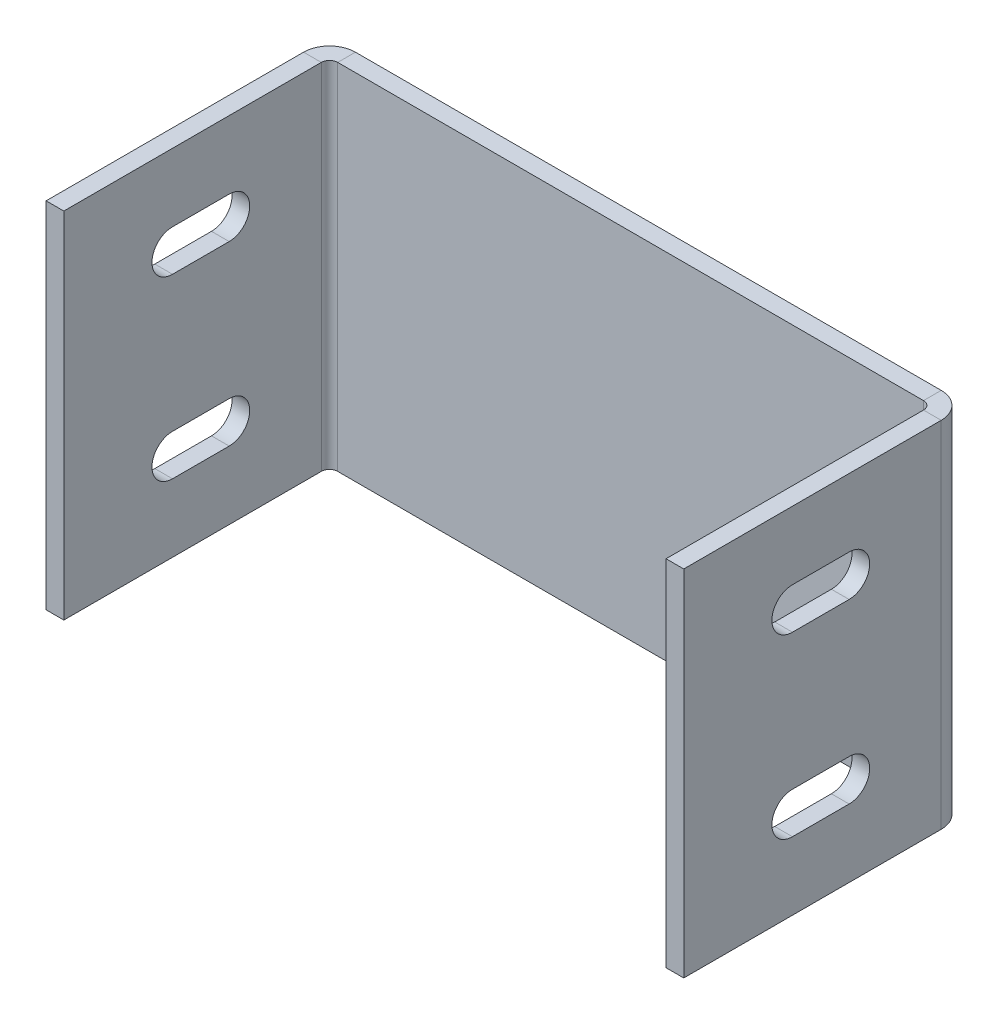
ISO-10303-21;
HEADER;
FILE_DESCRIPTION(('STEP AP214'),'2;1');
FILE_NAME('part.step','',(''),(''),'','','');
FILE_SCHEMA(('AUTOMOTIVE_DESIGN { 1 0 10303 214 1 1 1 1 }'));
ENDSEC;
DATA;
#1=APPLICATION_CONTEXT('core data for automotive mechanical design processes');
#2=APPLICATION_PROTOCOL_DEFINITION('international standard','automotive_design',2000,#1);
#3=PRODUCT_CONTEXT('',#1,'mechanical');
#4=PRODUCT('Part','Part','',(#3));
#5=PRODUCT_RELATED_PRODUCT_CATEGORY('part','',(#4));
#6=PRODUCT_DEFINITION_FORMATION('','',#4);
#7=PRODUCT_DEFINITION_CONTEXT('part definition',#1,'design');
#8=PRODUCT_DEFINITION('design','',#6,#7);
#9=PRODUCT_DEFINITION_SHAPE('','',#8);
#10=(LENGTH_UNIT() NAMED_UNIT(*) SI_UNIT(.MILLI.,.METRE.));
#11=(NAMED_UNIT(*) PLANE_ANGLE_UNIT() SI_UNIT($,.RADIAN.));
#12=(NAMED_UNIT(*) SI_UNIT($,.STERADIAN.) SOLID_ANGLE_UNIT());
#13=UNCERTAINTY_MEASURE_WITH_UNIT(LENGTH_MEASURE(1.E-05),#10,'distance_accuracy_value','');
#14=(GEOMETRIC_REPRESENTATION_CONTEXT(3) GLOBAL_UNCERTAINTY_ASSIGNED_CONTEXT((#13)) GLOBAL_UNIT_ASSIGNED_CONTEXT((#10,
#11,#12)) REPRESENTATION_CONTEXT('',''));
#15=CARTESIAN_POINT('',(0.,0.,0.));
#16=DIRECTION('',(0.,0.,1.));
#17=DIRECTION('',(1.,0.,0.));
#18=AXIS2_PLACEMENT_3D('',#15,#16,#17);
#19=CARTESIAN_POINT('',(0.,0.,-1.5875));
#20=DIRECTION('',(0.,0.,-1.));
#21=DIRECTION('',(-1.,0.,0.));
#22=AXIS2_PLACEMENT_3D('',#19,#20,#21);
#23=PLANE('',#22);
#24=DIRECTION('',(1.,0.,0.));
#25=VECTOR('',#24,1.);
#26=CARTESIAN_POINT('',(-26.9875,-15.875,-1.5875));
#27=LINE('',#26,#25);
#28=CARTESIAN_POINT('',(-26.2509,-15.875,-1.5875));
#29=VERTEX_POINT('',#28);
#30=CARTESIAN_POINT('',(26.2509,-15.875,-1.5875));
#31=VERTEX_POINT('',#30);
#32=EDGE_CURVE('E440',#29,#31,#27,.T.);
#33=ORIENTED_EDGE('',*,*,#32,.F.);
#34=DIRECTION('',(0.,-1.,0.));
#35=VECTOR('',#34,1.);
#36=CARTESIAN_POINT('',(-26.2509,-15.875,-1.5875));
#37=LINE('',#36,#35);
#38=CARTESIAN_POINT('',(-26.2509,15.875,-1.5875));
#39=VERTEX_POINT('',#38);
#40=EDGE_CURVE('E361',#29,#39,#37,.F.);
#41=ORIENTED_EDGE('',*,*,#40,.T.);
#42=DIRECTION('',(-1.,0.,0.));
#43=VECTOR('',#42,1.);
#44=CARTESIAN_POINT('',(-26.9875,15.875,-1.5875));
#45=LINE('',#44,#43);
#46=CARTESIAN_POINT('',(26.2509,15.875,-1.5875));
#47=VERTEX_POINT('',#46);
#48=EDGE_CURVE('E437',#47,#39,#45,.T.);
#49=ORIENTED_EDGE('',*,*,#48,.F.);
#50=DIRECTION('',(0.,1.,0.));
#51=VECTOR('',#50,1.);
#52=CARTESIAN_POINT('',(26.2509,15.875,-1.5875));
#53=LINE('',#52,#51);
#54=EDGE_CURVE('E414',#47,#31,#53,.F.);
#55=ORIENTED_EDGE('',*,*,#54,.T.);
#56=EDGE_LOOP('',(#33,#41,#49,#55));
#57=FACE_BOUND('',#56,.T.);
#58=ADVANCED_FACE('F40',(#57),#23,.T.);
#59=CARTESIAN_POINT('',(0.,0.,0.));
#60=DIRECTION('',(0.,0.,-1.));
#61=DIRECTION('',(-1.,0.,0.));
#62=AXIS2_PLACEMENT_3D('',#59,#60,#61);
#63=PLANE('',#62);
#64=DIRECTION('',(0.,-1.,0.));
#65=VECTOR('',#64,1.);
#66=CARTESIAN_POINT('',(-26.2509,-15.875,0.));
#67=LINE('',#66,#65);
#68=CARTESIAN_POINT('',(-26.2509,-15.875,0.));
#69=VERTEX_POINT('',#68);
#70=CARTESIAN_POINT('',(-26.2509,15.875,0.));
#71=VERTEX_POINT('',#70);
#72=EDGE_CURVE('E374',#69,#71,#67,.F.);
#73=ORIENTED_EDGE('',*,*,#72,.F.);
#74=DIRECTION('',(1.,0.,0.));
#75=VECTOR('',#74,1.);
#76=CARTESIAN_POINT('',(-26.9875,-15.875,0.));
#77=LINE('',#76,#75);
#78=CARTESIAN_POINT('',(26.2509,-15.875,0.));
#79=VERTEX_POINT('',#78);
#80=EDGE_CURVE('E441',#69,#79,#77,.T.);
#81=ORIENTED_EDGE('',*,*,#80,.T.);
#82=DIRECTION('',(0.,1.,0.));
#83=VECTOR('',#82,1.);
#84=CARTESIAN_POINT('',(26.2509,15.875,0.));
#85=LINE('',#84,#83);
#86=CARTESIAN_POINT('',(26.2509,15.875,0.));
#87=VERTEX_POINT('',#86);
#88=EDGE_CURVE('E427',#87,#79,#85,.F.);
#89=ORIENTED_EDGE('',*,*,#88,.F.);
#90=DIRECTION('',(-1.,0.,0.));
#91=VECTOR('',#90,1.);
#92=CARTESIAN_POINT('',(-26.9875,15.875,0.));
#93=LINE('',#92,#91);
#94=EDGE_CURVE('E434',#87,#71,#93,.T.);
#95=ORIENTED_EDGE('',*,*,#94,.T.);
#96=EDGE_LOOP('',(#73,#81,#89,#95));
#97=FACE_BOUND('',#96,.T.);
#98=ADVANCED_FACE('F484',(#97),#63,.F.);
#99=CARTESIAN_POINT('',(-26.9875,-15.875,-1.5875));
#100=DIRECTION('',(0.,-1.,0.));
#101=DIRECTION('',(0.,0.,-1.));
#102=AXIS2_PLACEMENT_3D('',#99,#100,#101);
#103=PLANE('',#102);
#104=ORIENTED_EDGE('',*,*,#80,.F.);
#105=DIRECTION('',(0.,0.,-1.));
#106=VECTOR('',#105,1.);
#107=CARTESIAN_POINT('',(-26.2509,-15.875,0.));
#108=LINE('',#107,#106);
#109=EDGE_CURVE('E368',#69,#29,#108,.T.);
#110=ORIENTED_EDGE('',*,*,#109,.T.);
#111=ORIENTED_EDGE('',*,*,#32,.T.);
#112=DIRECTION('',(0.,0.,-1.));
#113=VECTOR('',#112,1.);
#114=CARTESIAN_POINT('',(26.2509,-15.875,0.));
#115=LINE('',#114,#113);
#116=EDGE_CURVE('E431',#79,#31,#115,.T.);
#117=ORIENTED_EDGE('',*,*,#116,.F.);
#118=EDGE_LOOP('',(#104,#110,#111,#117));
#119=FACE_BOUND('',#118,.T.);
#120=ADVANCED_FACE('F490',(#119),#103,.T.);
#121=CARTESIAN_POINT('',(-26.9875,15.875,-1.5875));
#122=DIRECTION('',(0.,1.,0.));
#123=DIRECTION('',(0.,0.,1.));
#124=AXIS2_PLACEMENT_3D('',#121,#122,#123);
#125=PLANE('',#124);
#126=DIRECTION('',(0.,0.,-1.));
#127=VECTOR('',#126,1.);
#128=CARTESIAN_POINT('',(-26.2509,15.875,0.));
#129=LINE('',#128,#127);
#130=EDGE_CURVE('E378',#71,#39,#129,.T.);
#131=ORIENTED_EDGE('',*,*,#130,.F.);
#132=ORIENTED_EDGE('',*,*,#94,.F.);
#133=DIRECTION('',(0.,0.,-1.));
#134=VECTOR('',#133,1.);
#135=CARTESIAN_POINT('',(26.2509,15.875,0.));
#136=LINE('',#135,#134);
#137=EDGE_CURVE('E421',#87,#47,#136,.T.);
#138=ORIENTED_EDGE('',*,*,#137,.T.);
#139=ORIENTED_EDGE('',*,*,#48,.T.);
#140=EDGE_LOOP('',(#131,#132,#138,#139));
#141=FACE_BOUND('',#140,.T.);
#142=ADVANCED_FACE('F42',(#141),#125,.T.);
#143=CARTESIAN_POINT('',(26.2509,-15.875,0.7366));
#144=DIRECTION('',(0.,-1.,0.));
#145=DIRECTION('',(0.,0.,-1.));
#146=AXIS2_PLACEMENT_3D('',#143,#144,#145);
#147=PLANE('',#146);
#148=DIRECTION('',(1.,0.,0.));
#149=VECTOR('',#148,1.);
#150=CARTESIAN_POINT('',(26.9875,-15.875,0.736599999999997));
#151=LINE('',#150,#149);
#152=CARTESIAN_POINT('',(26.9875,-15.875,0.736599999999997));
#153=VERTEX_POINT('',#152);
#154=CARTESIAN_POINT('',(28.575,-15.875,0.736599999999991));
#155=VERTEX_POINT('',#154);
#156=EDGE_CURVE('E381',#153,#155,#151,.T.);
#157=ORIENTED_EDGE('',*,*,#156,.F.);
#158=CARTESIAN_POINT('',(26.2509,-15.875,0.7366));
#159=DIRECTION('',(0.,1.,0.));
#160=DIRECTION('',(0.,0.,1.));
#161=AXIS2_PLACEMENT_3D('',#158,#159,#160);
#162=CIRCLE('',#161,0.7366);
#163=EDGE_CURVE('E424',#79,#153,#162,.F.);
#164=ORIENTED_EDGE('',*,*,#163,.F.);
#165=ORIENTED_EDGE('',*,*,#116,.T.);
#166=CARTESIAN_POINT('',(26.2509,-15.875,0.7366));
#167=DIRECTION('',(0.,1.,0.));
#168=DIRECTION('',(0.,0.,1.));
#169=AXIS2_PLACEMENT_3D('',#166,#167,#168);
#170=CIRCLE('',#169,2.3241);
#171=EDGE_CURVE('E417',#31,#155,#170,.F.);
#172=ORIENTED_EDGE('',*,*,#171,.T.);
#173=EDGE_LOOP('',(#157,#164,#165,#172));
#174=FACE_BOUND('',#173,.T.);
#175=ADVANCED_FACE('F502',(#174),#147,.T.);
#176=CARTESIAN_POINT('',(26.2509,15.875,0.7366));
#177=DIRECTION('',(0.,-1.,0.));
#178=DIRECTION('',(0.,0.,-1.));
#179=AXIS2_PLACEMENT_3D('',#176,#177,#178);
#180=PLANE('',#179);
#181=CARTESIAN_POINT('',(26.2509,15.875,0.7366));
#182=DIRECTION('',(0.,1.,0.));
#183=DIRECTION('',(0.,0.,1.));
#184=AXIS2_PLACEMENT_3D('',#181,#182,#183);
#185=CIRCLE('',#184,0.7366);
#186=CARTESIAN_POINT('',(26.9875,15.875,0.736599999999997));
#187=VERTEX_POINT('',#186);
#188=EDGE_CURVE('E413',#187,#87,#185,.T.);
#189=ORIENTED_EDGE('',*,*,#188,.F.);
#190=DIRECTION('',(1.,0.,0.));
#191=VECTOR('',#190,1.);
#192=CARTESIAN_POINT('',(26.9875,15.875,0.736599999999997));
#193=LINE('',#192,#191);
#194=CARTESIAN_POINT('',(28.575,15.875,0.736599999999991));
#195=VERTEX_POINT('',#194);
#196=EDGE_CURVE('E386',#187,#195,#193,.T.);
#197=ORIENTED_EDGE('',*,*,#196,.T.);
#198=CARTESIAN_POINT('',(26.2509,15.875,0.7366));
#199=DIRECTION('',(0.,1.,0.));
#200=DIRECTION('',(0.,0.,1.));
#201=AXIS2_PLACEMENT_3D('',#198,#199,#200);
#202=CIRCLE('',#201,2.3241);
#203=EDGE_CURVE('E418',#195,#47,#202,.T.);
#204=ORIENTED_EDGE('',*,*,#203,.T.);
#205=ORIENTED_EDGE('',*,*,#137,.F.);
#206=EDGE_LOOP('',(#189,#197,#204,#205));
#207=FACE_BOUND('',#206,.T.);
#208=ADVANCED_FACE('F495',(#207),#180,.F.);
#209=CARTESIAN_POINT('',(26.2509,15.875,0.7366));
#210=DIRECTION('',(0.,1.,0.));
#211=DIRECTION('',(1.,0.,0.));
#212=AXIS2_PLACEMENT_3D('',#209,#210,#211);
#213=CYLINDRICAL_SURFACE('',#212,2.3241);
#214=ORIENTED_EDGE('',*,*,#54,.F.);
#215=ORIENTED_EDGE('',*,*,#203,.F.);
#216=DIRECTION('',(0.,-1.,0.));
#217=VECTOR('',#216,1.);
#218=CARTESIAN_POINT('',(28.575,0.,0.736599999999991));
#219=LINE('',#218,#217);
#220=EDGE_CURVE('E389',#195,#155,#219,.T.);
#221=ORIENTED_EDGE('',*,*,#220,.T.);
#222=ORIENTED_EDGE('',*,*,#171,.F.);
#223=EDGE_LOOP('',(#214,#215,#221,#222));
#224=FACE_BOUND('',#223,.T.);
#225=ADVANCED_FACE('F584',(#224),#213,.T.);
#226=CARTESIAN_POINT('',(26.2509,15.875,0.7366));
#227=DIRECTION('',(0.,1.,0.));
#228=DIRECTION('',(1.,0.,0.));
#229=AXIS2_PLACEMENT_3D('',#226,#227,#228);
#230=CYLINDRICAL_SURFACE('',#229,0.7366);
#231=ORIENTED_EDGE('',*,*,#88,.T.);
#232=ORIENTED_EDGE('',*,*,#163,.T.);
#233=DIRECTION('',(0.,1.,0.));
#234=VECTOR('',#233,1.);
#235=CARTESIAN_POINT('',(26.9875,-15.875,0.736599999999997));
#236=LINE('',#235,#234);
#237=EDGE_CURVE('E384',#153,#187,#236,.T.);
#238=ORIENTED_EDGE('',*,*,#237,.T.);
#239=ORIENTED_EDGE('',*,*,#188,.T.);
#240=EDGE_LOOP('',(#231,#232,#238,#239));
#241=FACE_BOUND('',#240,.T.);
#242=ADVANCED_FACE('F582',(#241),#230,.F.);
#243=CARTESIAN_POINT('',(28.5750000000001,15.875,23.8125));
#244=DIRECTION('',(0.,-1.,0.));
#245=DIRECTION('',(0.,0.,-1.));
#246=AXIS2_PLACEMENT_3D('',#243,#244,#245);
#247=PLANE('',#246);
#248=ORIENTED_EDGE('',*,*,#196,.F.);
#249=DIRECTION('',(0.,0.,1.));
#250=VECTOR('',#249,1.);
#251=CARTESIAN_POINT('',(26.9875000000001,15.875,23.8125));
#252=LINE('',#251,#250);
#253=CARTESIAN_POINT('',(26.9875000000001,15.875,23.8125));
#254=VERTEX_POINT('',#253);
#255=EDGE_CURVE('E393',#187,#254,#252,.T.);
#256=ORIENTED_EDGE('',*,*,#255,.T.);
#257=DIRECTION('',(-1.,0.,0.));
#258=VECTOR('',#257,1.);
#259=CARTESIAN_POINT('',(28.5750000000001,15.875,23.8125));
#260=LINE('',#259,#258);
#261=CARTESIAN_POINT('',(28.5750000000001,15.875,23.8125));
#262=VERTEX_POINT('',#261);
#263=EDGE_CURVE('E410',#262,#254,#260,.T.);
#264=ORIENTED_EDGE('',*,*,#263,.F.);
#265=DIRECTION('',(0.,0.,1.));
#266=VECTOR('',#265,1.);
#267=CARTESIAN_POINT('',(28.5750000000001,15.875,23.8125));
#268=LINE('',#267,#266);
#269=EDGE_CURVE('E394',#195,#262,#268,.T.);
#270=ORIENTED_EDGE('',*,*,#269,.F.);
#271=EDGE_LOOP('',(#248,#256,#264,#270));
#272=FACE_BOUND('',#271,.T.);
#273=ADVANCED_FACE('F575',(#272),#247,.F.);
#274=CARTESIAN_POINT('',(28.575,-15.875,0.));
#275=DIRECTION('',(0.,1.,0.));
#276=DIRECTION('',(0.,0.,1.));
#277=AXIS2_PLACEMENT_3D('',#274,#275,#276);
#278=PLANE('',#277);
#279=ORIENTED_EDGE('',*,*,#156,.T.);
#280=DIRECTION('',(0.,0.,-1.));
#281=VECTOR('',#280,1.);
#282=CARTESIAN_POINT('',(28.575,-15.875,0.));
#283=LINE('',#282,#281);
#284=CARTESIAN_POINT('',(28.5750000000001,-15.875,23.8125));
#285=VERTEX_POINT('',#284);
#286=EDGE_CURVE('E399',#285,#155,#283,.T.);
#287=ORIENTED_EDGE('',*,*,#286,.F.);
#288=DIRECTION('',(-1.,0.,0.));
#289=VECTOR('',#288,1.);
#290=CARTESIAN_POINT('',(28.5750000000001,-15.875,23.8125));
#291=LINE('',#290,#289);
#292=CARTESIAN_POINT('',(26.9875000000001,-15.875,23.8125));
#293=VERTEX_POINT('',#292);
#294=EDGE_CURVE('E402',#285,#293,#291,.T.);
#295=ORIENTED_EDGE('',*,*,#294,.T.);
#296=DIRECTION('',(0.,0.,-1.));
#297=VECTOR('',#296,1.);
#298=CARTESIAN_POINT('',(26.9875,-15.875,0.));
#299=LINE('',#298,#297);
#300=EDGE_CURVE('E397',#293,#153,#299,.T.);
#301=ORIENTED_EDGE('',*,*,#300,.T.);
#302=EDGE_LOOP('',(#279,#287,#295,#301));
#303=FACE_BOUND('',#302,.T.);
#304=ADVANCED_FACE('F568',(#303),#278,.F.);
#305=CARTESIAN_POINT('',(28.575,0.,0.));
#306=DIRECTION('',(-1.,0.,0.));
#307=DIRECTION('',(0.,0.,1.));
#308=AXIS2_PLACEMENT_3D('',#305,#306,#307);
#309=PLANE('',#308);
#310=DIRECTION('',(0.,0.,-1.));
#311=VECTOR('',#310,1.);
#312=CARTESIAN_POINT('',(28.575,6.09600000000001,14.0716));
#313=LINE('',#312,#311);
#314=CARTESIAN_POINT('',(28.575,6.09600000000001,14.0716000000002));
#315=VERTEX_POINT('',#314);
#316=CARTESIAN_POINT('',(28.575,6.09600000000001,8.99159999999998));
#317=VERTEX_POINT('',#316);
#318=EDGE_CURVE('E262',#315,#317,#313,.T.);
#319=ORIENTED_EDGE('',*,*,#318,.F.);
#320=CARTESIAN_POINT('',(28.575,7.9375,14.0716));
#321=DIRECTION('',(1.,0.,0.));
#322=DIRECTION('',(0.,0.,-1.));
#323=AXIS2_PLACEMENT_3D('',#320,#321,#322);
#324=CIRCLE('',#323,1.8415);
#325=CARTESIAN_POINT('',(28.575,9.779,14.0716));
#326=VERTEX_POINT('',#325);
#327=EDGE_CURVE('E55',#326,#315,#324,.T.);
#328=ORIENTED_EDGE('',*,*,#327,.F.);
#329=DIRECTION('',(0.,0.,1.));
#330=VECTOR('',#329,1.);
#331=CARTESIAN_POINT('',(28.575,9.779,14.0716));
#332=LINE('',#331,#330);
#333=CARTESIAN_POINT('',(28.575,9.779,8.99159999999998));
#334=VERTEX_POINT('',#333);
#335=EDGE_CURVE('E253',#334,#326,#332,.T.);
#336=ORIENTED_EDGE('',*,*,#335,.F.);
#337=CARTESIAN_POINT('',(28.575,7.9375,8.99159999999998));
#338=DIRECTION('',(1.,0.,0.));
#339=DIRECTION('',(0.,0.,-1.));
#340=AXIS2_PLACEMENT_3D('',#337,#338,#339);
#341=CIRCLE('',#340,1.8415);
#342=EDGE_CURVE('E256',#317,#334,#341,.T.);
#343=ORIENTED_EDGE('',*,*,#342,.F.);
#344=EDGE_LOOP('',(#319,#328,#336,#343));
#345=FACE_BOUND('',#344,.T.);
#346=DIRECTION('',(0.,0.,-1.));
#347=VECTOR('',#346,1.);
#348=CARTESIAN_POINT('',(28.575,-9.779,14.0716));
#349=LINE('',#348,#347);
#350=CARTESIAN_POINT('',(28.575,-9.779,14.0716000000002));
#351=VERTEX_POINT('',#350);
#352=CARTESIAN_POINT('',(28.575,-9.779,8.99159999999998));
#353=VERTEX_POINT('',#352);
#354=EDGE_CURVE('E292',#351,#353,#349,.T.);
#355=ORIENTED_EDGE('',*,*,#354,.F.);
#356=CARTESIAN_POINT('',(28.575,-7.9375,14.0716));
#357=DIRECTION('',(1.,0.,0.));
#358=DIRECTION('',(0.,0.,-1.));
#359=AXIS2_PLACEMENT_3D('',#356,#357,#358);
#360=CIRCLE('',#359,1.8415);
#361=CARTESIAN_POINT('',(28.575,-6.096,14.0716));
#362=VERTEX_POINT('',#361);
#363=EDGE_CURVE('E63',#362,#351,#360,.T.);
#364=ORIENTED_EDGE('',*,*,#363,.F.);
#365=DIRECTION('',(0.,0.,1.));
#366=VECTOR('',#365,1.);
#367=CARTESIAN_POINT('',(28.575,-6.096,14.0716));
#368=LINE('',#367,#366);
#369=CARTESIAN_POINT('',(28.575,-6.096,8.99159999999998));
#370=VERTEX_POINT('',#369);
#371=EDGE_CURVE('E281',#370,#362,#368,.T.);
#372=ORIENTED_EDGE('',*,*,#371,.F.);
#373=CARTESIAN_POINT('',(28.575,-7.9375,8.99159999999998));
#374=DIRECTION('',(1.,0.,0.));
#375=DIRECTION('',(0.,0.,-1.));
#376=AXIS2_PLACEMENT_3D('',#373,#374,#375);
#377=CIRCLE('',#376,1.8415);
#378=EDGE_CURVE('E295',#353,#370,#377,.T.);
#379=ORIENTED_EDGE('',*,*,#378,.F.);
#380=EDGE_LOOP('',(#355,#364,#372,#379));
#381=FACE_BOUND('',#380,.T.);
#382=ORIENTED_EDGE('',*,*,#220,.F.);
#383=ORIENTED_EDGE('',*,*,#269,.T.);
#384=DIRECTION('',(0.,-1.,0.));
#385=VECTOR('',#384,1.);
#386=CARTESIAN_POINT('',(28.5750000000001,-15.875,23.8125));
#387=LINE('',#386,#385);
#388=EDGE_CURVE('E396',#262,#285,#387,.T.);
#389=ORIENTED_EDGE('',*,*,#388,.T.);
#390=ORIENTED_EDGE('',*,*,#286,.T.);
#391=EDGE_LOOP('',(#382,#383,#389,#390));
#392=FACE_BOUND('',#391,.T.);
#393=ADVANCED_FACE('F564',(#345,#381,#392),#309,.F.);
#394=CARTESIAN_POINT('',(26.9875,0.,0.));
#395=DIRECTION('',(-1.,0.,0.));
#396=DIRECTION('',(0.,0.,1.));
#397=AXIS2_PLACEMENT_3D('',#394,#395,#396);
#398=PLANE('',#397);
#399=CARTESIAN_POINT('',(26.9875,7.9375,14.0716));
#400=DIRECTION('',(-1.,0.,0.));
#401=DIRECTION('',(0.,0.,1.));
#402=AXIS2_PLACEMENT_3D('',#399,#400,#401);
#403=CIRCLE('',#402,1.8415);
#404=CARTESIAN_POINT('',(26.9875,6.09600000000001,14.0716));
#405=VERTEX_POINT('',#404);
#406=CARTESIAN_POINT('',(26.9875,9.779,14.0716));
#407=VERTEX_POINT('',#406);
#408=EDGE_CURVE('E328',#405,#407,#403,.T.);
#409=ORIENTED_EDGE('',*,*,#408,.F.);
#410=DIRECTION('',(0.,0.,1.));
#411=VECTOR('',#410,1.);
#412=CARTESIAN_POINT('',(26.9875,6.09600000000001,0.));
#413=LINE('',#412,#411);
#414=CARTESIAN_POINT('',(26.9875,6.09600000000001,8.99159999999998));
#415=VERTEX_POINT('',#414);
#416=EDGE_CURVE('E321',#415,#405,#413,.T.);
#417=ORIENTED_EDGE('',*,*,#416,.F.);
#418=CARTESIAN_POINT('',(26.9875,7.9375,8.99159999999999));
#419=DIRECTION('',(-1.,0.,0.));
#420=DIRECTION('',(0.,0.,1.));
#421=AXIS2_PLACEMENT_3D('',#418,#419,#420);
#422=CIRCLE('',#421,1.8415);
#423=CARTESIAN_POINT('',(26.9875,9.779,8.99159999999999));
#424=VERTEX_POINT('',#423);
#425=EDGE_CURVE('E323',#424,#415,#422,.T.);
#426=ORIENTED_EDGE('',*,*,#425,.F.);
#427=DIRECTION('',(0.,0.,-1.));
#428=VECTOR('',#427,1.);
#429=CARTESIAN_POINT('',(26.9875,9.77900000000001,0.));
#430=LINE('',#429,#428);
#431=EDGE_CURVE('E326',#407,#424,#430,.T.);
#432=ORIENTED_EDGE('',*,*,#431,.F.);
#433=EDGE_LOOP('',(#409,#417,#426,#432));
#434=FACE_BOUND('',#433,.T.);
#435=CARTESIAN_POINT('',(26.9875,-7.9375,14.0716));
#436=DIRECTION('',(-1.,0.,0.));
#437=DIRECTION('',(0.,0.,1.));
#438=AXIS2_PLACEMENT_3D('',#435,#436,#437);
#439=CIRCLE('',#438,1.8415);
#440=CARTESIAN_POINT('',(26.9875,-9.779,14.0716));
#441=VERTEX_POINT('',#440);
#442=CARTESIAN_POINT('',(26.9875,-6.096,14.0716));
#443=VERTEX_POINT('',#442);
#444=EDGE_CURVE('E319',#441,#443,#439,.T.);
#445=ORIENTED_EDGE('',*,*,#444,.F.);
#446=DIRECTION('',(0.,0.,1.));
#447=VECTOR('',#446,1.);
#448=CARTESIAN_POINT('',(26.9875,-9.779,0.));
#449=LINE('',#448,#447);
#450=CARTESIAN_POINT('',(26.9875,-9.779,8.99159999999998));
#451=VERTEX_POINT('',#450);
#452=EDGE_CURVE('E270',#451,#441,#449,.T.);
#453=ORIENTED_EDGE('',*,*,#452,.F.);
#454=CARTESIAN_POINT('',(26.9875,-7.9375,8.99159999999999));
#455=DIRECTION('',(-1.,0.,0.));
#456=DIRECTION('',(0.,0.,1.));
#457=AXIS2_PLACEMENT_3D('',#454,#455,#456);
#458=CIRCLE('',#457,1.8415);
#459=CARTESIAN_POINT('',(26.9875,-6.096,8.99159999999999));
#460=VERTEX_POINT('',#459);
#461=EDGE_CURVE('E314',#460,#451,#458,.T.);
#462=ORIENTED_EDGE('',*,*,#461,.F.);
#463=DIRECTION('',(0.,0.,-1.));
#464=VECTOR('',#463,1.);
#465=CARTESIAN_POINT('',(26.9875,-6.096,0.));
#466=LINE('',#465,#464);
#467=EDGE_CURVE('E317',#443,#460,#466,.T.);
#468=ORIENTED_EDGE('',*,*,#467,.F.);
#469=EDGE_LOOP('',(#445,#453,#462,#468));
#470=FACE_BOUND('',#469,.T.);
#471=ORIENTED_EDGE('',*,*,#255,.F.);
#472=ORIENTED_EDGE('',*,*,#237,.F.);
#473=ORIENTED_EDGE('',*,*,#300,.F.);
#474=DIRECTION('',(0.,-1.,0.));
#475=VECTOR('',#474,1.);
#476=CARTESIAN_POINT('',(26.9875000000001,-15.875,23.8125));
#477=LINE('',#476,#475);
#478=EDGE_CURVE('E404',#254,#293,#477,.T.);
#479=ORIENTED_EDGE('',*,*,#478,.F.);
#480=EDGE_LOOP('',(#471,#472,#473,#479));
#481=FACE_BOUND('',#480,.T.);
#482=ADVANCED_FACE('F567',(#434,#470,#481),#398,.T.);
#483=CARTESIAN_POINT('',(28.5750000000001,-15.875,23.8125));
#484=DIRECTION('',(0.,0.,-1.));
#485=DIRECTION('',(-1.,0.,0.));
#486=AXIS2_PLACEMENT_3D('',#483,#484,#485);
#487=PLANE('',#486);
#488=ORIENTED_EDGE('',*,*,#478,.T.);
#489=ORIENTED_EDGE('',*,*,#294,.F.);
#490=ORIENTED_EDGE('',*,*,#388,.F.);
#491=ORIENTED_EDGE('',*,*,#263,.T.);
#492=EDGE_LOOP('',(#488,#489,#490,#491));
#493=FACE_BOUND('',#492,.T.);
#494=ADVANCED_FACE('F561',(#493),#487,.F.);
#495=CARTESIAN_POINT('',(-26.2509,15.875,0.7366));
#496=DIRECTION('',(0.,1.,0.));
#497=DIRECTION('',(0.,0.,1.));
#498=AXIS2_PLACEMENT_3D('',#495,#496,#497);
#499=PLANE('',#498);
#500=DIRECTION('',(-1.,0.,0.));
#501=VECTOR('',#500,1.);
#502=CARTESIAN_POINT('',(-26.9875,15.875,0.736599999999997));
#503=LINE('',#502,#501);
#504=CARTESIAN_POINT('',(-26.9875,15.875,0.736599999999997));
#505=VERTEX_POINT('',#504);
#506=CARTESIAN_POINT('',(-28.575,15.875,0.736599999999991));
#507=VERTEX_POINT('',#506);
#508=EDGE_CURVE('E330',#505,#507,#503,.T.);
#509=ORIENTED_EDGE('',*,*,#508,.F.);
#510=CARTESIAN_POINT('',(-26.2509,15.875,0.7366));
#511=DIRECTION('',(0.,-1.,0.));
#512=DIRECTION('',(0.,0.,-1.));
#513=AXIS2_PLACEMENT_3D('',#510,#511,#512);
#514=CIRCLE('',#513,0.7366);
#515=EDGE_CURVE('E371',#71,#505,#514,.F.);
#516=ORIENTED_EDGE('',*,*,#515,.F.);
#517=ORIENTED_EDGE('',*,*,#130,.T.);
#518=CARTESIAN_POINT('',(-26.2509,15.875,0.7366));
#519=DIRECTION('',(0.,-1.,0.));
#520=DIRECTION('',(0.,0.,-1.));
#521=AXIS2_PLACEMENT_3D('',#518,#519,#520);
#522=CIRCLE('',#521,2.3241);
#523=EDGE_CURVE('E364',#39,#507,#522,.F.);
#524=ORIENTED_EDGE('',*,*,#523,.T.);
#525=EDGE_LOOP('',(#509,#516,#517,#524));
#526=FACE_BOUND('',#525,.T.);
#527=ADVANCED_FACE('F516',(#526),#499,.T.);
#528=CARTESIAN_POINT('',(-26.2509,-15.875,0.7366));
#529=DIRECTION('',(0.,1.,0.));
#530=DIRECTION('',(0.,0.,1.));
#531=AXIS2_PLACEMENT_3D('',#528,#529,#530);
#532=PLANE('',#531);
#533=CARTESIAN_POINT('',(-26.2509,-15.875,0.7366));
#534=DIRECTION('',(0.,-1.,0.));
#535=DIRECTION('',(0.,0.,-1.));
#536=AXIS2_PLACEMENT_3D('',#533,#534,#535);
#537=CIRCLE('',#536,0.7366);
#538=CARTESIAN_POINT('',(-26.9875,-15.875,0.736599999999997));
#539=VERTEX_POINT('',#538);
#540=EDGE_CURVE('E360',#539,#69,#537,.T.);
#541=ORIENTED_EDGE('',*,*,#540,.F.);
#542=DIRECTION('',(-1.,0.,0.));
#543=VECTOR('',#542,1.);
#544=CARTESIAN_POINT('',(-26.9875,-15.875,0.736599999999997));
#545=LINE('',#544,#543);
#546=CARTESIAN_POINT('',(-28.575,-15.875,0.736599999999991));
#547=VERTEX_POINT('',#546);
#548=EDGE_CURVE('E333',#539,#547,#545,.T.);
#549=ORIENTED_EDGE('',*,*,#548,.T.);
#550=CARTESIAN_POINT('',(-26.2509,-15.875,0.7366));
#551=DIRECTION('',(0.,-1.,0.));
#552=DIRECTION('',(0.,0.,-1.));
#553=AXIS2_PLACEMENT_3D('',#550,#551,#552);
#554=CIRCLE('',#553,2.3241);
#555=EDGE_CURVE('E365',#547,#29,#554,.T.);
#556=ORIENTED_EDGE('',*,*,#555,.T.);
#557=ORIENTED_EDGE('',*,*,#109,.F.);
#558=EDGE_LOOP('',(#541,#549,#556,#557));
#559=FACE_BOUND('',#558,.T.);
#560=ADVANCED_FACE('F521',(#559),#532,.F.);
#561=CARTESIAN_POINT('',(-26.2509,-15.875,0.7366));
#562=DIRECTION('',(0.,-1.,0.));
#563=DIRECTION('',(-1.,0.,0.));
#564=AXIS2_PLACEMENT_3D('',#561,#562,#563);
#565=CYLINDRICAL_SURFACE('',#564,2.3241);
#566=ORIENTED_EDGE('',*,*,#40,.F.);
#567=ORIENTED_EDGE('',*,*,#555,.F.);
#568=DIRECTION('',(0.,1.,0.));
#569=VECTOR('',#568,1.);
#570=CARTESIAN_POINT('',(-28.575,0.,0.736599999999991));
#571=LINE('',#570,#569);
#572=EDGE_CURVE('E336',#547,#507,#571,.T.);
#573=ORIENTED_EDGE('',*,*,#572,.T.);
#574=ORIENTED_EDGE('',*,*,#523,.F.);
#575=EDGE_LOOP('',(#566,#567,#573,#574));
#576=FACE_BOUND('',#575,.T.);
#577=ADVANCED_FACE('F519',(#576),#565,.T.);
#578=CARTESIAN_POINT('',(-26.2509,-15.875,0.7366));
#579=DIRECTION('',(0.,-1.,0.));
#580=DIRECTION('',(-1.,0.,0.));
#581=AXIS2_PLACEMENT_3D('',#578,#579,#580);
#582=CYLINDRICAL_SURFACE('',#581,0.7366);
#583=ORIENTED_EDGE('',*,*,#72,.T.);
#584=ORIENTED_EDGE('',*,*,#515,.T.);
#585=DIRECTION('',(0.,-1.,0.));
#586=VECTOR('',#585,1.);
#587=CARTESIAN_POINT('',(-26.9875,15.875,0.736599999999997));
#588=LINE('',#587,#586);
#589=EDGE_CURVE('E331',#505,#539,#588,.T.);
#590=ORIENTED_EDGE('',*,*,#589,.T.);
#591=ORIENTED_EDGE('',*,*,#540,.T.);
#592=EDGE_LOOP('',(#583,#584,#590,#591));
#593=FACE_BOUND('',#592,.T.);
#594=ADVANCED_FACE('F511',(#593),#582,.F.);
#595=CARTESIAN_POINT('',(-28.575,15.875,0.));
#596=DIRECTION('',(0.,-1.,0.));
#597=DIRECTION('',(0.,0.,-1.));
#598=AXIS2_PLACEMENT_3D('',#595,#596,#597);
#599=PLANE('',#598);
#600=ORIENTED_EDGE('',*,*,#508,.T.);
#601=DIRECTION('',(0.,0.,-1.));
#602=VECTOR('',#601,1.);
#603=CARTESIAN_POINT('',(-28.575,15.875,0.));
#604=LINE('',#603,#602);
#605=CARTESIAN_POINT('',(-28.5750000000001,15.875,23.8125));
#606=VERTEX_POINT('',#605);
#607=EDGE_CURVE('E341',#606,#507,#604,.T.);
#608=ORIENTED_EDGE('',*,*,#607,.F.);
#609=DIRECTION('',(1.,0.,0.));
#610=VECTOR('',#609,1.);
#611=CARTESIAN_POINT('',(-28.5750000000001,15.875,23.8125));
#612=LINE('',#611,#610);
#613=CARTESIAN_POINT('',(-26.9875000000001,15.875,23.8125));
#614=VERTEX_POINT('',#613);
#615=EDGE_CURVE('E349',#606,#614,#612,.T.);
#616=ORIENTED_EDGE('',*,*,#615,.T.);
#617=DIRECTION('',(0.,0.,-1.));
#618=VECTOR('',#617,1.);
#619=CARTESIAN_POINT('',(-26.9875,15.875,0.));
#620=LINE('',#619,#618);
#621=EDGE_CURVE('E340',#614,#505,#620,.T.);
#622=ORIENTED_EDGE('',*,*,#621,.T.);
#623=EDGE_LOOP('',(#600,#608,#616,#622));
#624=FACE_BOUND('',#623,.T.);
#625=ADVANCED_FACE('F538',(#624),#599,.F.);
#626=CARTESIAN_POINT('',(-28.5750000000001,-15.875,23.8125));
#627=DIRECTION('',(0.,1.,0.));
#628=DIRECTION('',(0.,0.,1.));
#629=AXIS2_PLACEMENT_3D('',#626,#627,#628);
#630=PLANE('',#629);
#631=ORIENTED_EDGE('',*,*,#548,.F.);
#632=DIRECTION('',(0.,0.,1.));
#633=VECTOR('',#632,1.);
#634=CARTESIAN_POINT('',(-26.9875000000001,-15.875,23.8125));
#635=LINE('',#634,#633);
#636=CARTESIAN_POINT('',(-26.9875000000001,-15.875,23.8125));
#637=VERTEX_POINT('',#636);
#638=EDGE_CURVE('E352',#539,#637,#635,.T.);
#639=ORIENTED_EDGE('',*,*,#638,.T.);
#640=DIRECTION('',(1.,0.,0.));
#641=VECTOR('',#640,1.);
#642=CARTESIAN_POINT('',(-28.5750000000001,-15.875,23.8125));
#643=LINE('',#642,#641);
#644=CARTESIAN_POINT('',(-28.5750000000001,-15.875,23.8125));
#645=VERTEX_POINT('',#644);
#646=EDGE_CURVE('E357',#645,#637,#643,.T.);
#647=ORIENTED_EDGE('',*,*,#646,.F.);
#648=DIRECTION('',(0.,0.,1.));
#649=VECTOR('',#648,1.);
#650=CARTESIAN_POINT('',(-28.5750000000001,-15.875,23.8125));
#651=LINE('',#650,#649);
#652=EDGE_CURVE('E344',#547,#645,#651,.T.);
#653=ORIENTED_EDGE('',*,*,#652,.F.);
#654=EDGE_LOOP('',(#631,#639,#647,#653));
#655=FACE_BOUND('',#654,.T.);
#656=ADVANCED_FACE('F530',(#655),#630,.F.);
#657=CARTESIAN_POINT('',(-28.575,0.,0.));
#658=DIRECTION('',(1.,0.,0.));
#659=DIRECTION('',(0.,0.,-1.));
#660=AXIS2_PLACEMENT_3D('',#657,#658,#659);
#661=PLANE('',#660);
#662=DIRECTION('',(0.,0.,1.));
#663=VECTOR('',#662,1.);
#664=CARTESIAN_POINT('',(-28.5750000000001,9.779,14.0716000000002));
#665=LINE('',#664,#663);
#666=CARTESIAN_POINT('',(-28.5750000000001,9.779,8.99160000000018));
#667=VERTEX_POINT('',#666);
#668=CARTESIAN_POINT('',(-28.5750000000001,9.779,14.0716000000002));
#669=VERTEX_POINT('',#668);
#670=EDGE_CURVE('E252',#667,#669,#665,.T.);
#671=ORIENTED_EDGE('',*,*,#670,.T.);
#672=CARTESIAN_POINT('',(-28.5750000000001,7.9375,14.0716000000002));
#673=DIRECTION('',(1.,0.,0.));
#674=DIRECTION('',(0.,0.,-1.));
#675=AXIS2_PLACEMENT_3D('',#672,#673,#674);
#676=CIRCLE('',#675,1.8415);
#677=CARTESIAN_POINT('',(-28.5750000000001,6.09600000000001,14.0716000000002));
#678=VERTEX_POINT('',#677);
#679=EDGE_CURVE('E231',#669,#678,#676,.T.);
#680=ORIENTED_EDGE('',*,*,#679,.T.);
#681=DIRECTION('',(0.,0.,-1.));
#682=VECTOR('',#681,1.);
#683=CARTESIAN_POINT('',(-28.5750000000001,6.09600000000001,14.0716000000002));
#684=LINE('',#683,#682);
#685=CARTESIAN_POINT('',(-28.575,6.09600000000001,8.99159999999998));
#686=VERTEX_POINT('',#685);
#687=EDGE_CURVE('E241',#678,#686,#684,.T.);
#688=ORIENTED_EDGE('',*,*,#687,.T.);
#689=CARTESIAN_POINT('',(-28.5750000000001,7.9375,8.99160000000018));
#690=DIRECTION('',(1.,0.,0.));
#691=DIRECTION('',(0.,0.,-1.));
#692=AXIS2_PLACEMENT_3D('',#689,#690,#691);
#693=CIRCLE('',#692,1.8415);
#694=EDGE_CURVE('E247',#686,#667,#693,.T.);
#695=ORIENTED_EDGE('',*,*,#694,.T.);
#696=EDGE_LOOP('',(#671,#680,#688,#695));
#697=FACE_BOUND('',#696,.T.);
#698=DIRECTION('',(0.,0.,1.));
#699=VECTOR('',#698,1.);
#700=CARTESIAN_POINT('',(-28.5750000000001,-6.096,14.0716000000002));
#701=LINE('',#700,#699);
#702=CARTESIAN_POINT('',(-28.5750000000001,-6.096,8.99160000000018));
#703=VERTEX_POINT('',#702);
#704=CARTESIAN_POINT('',(-28.5750000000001,-6.096,14.0716000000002));
#705=VERTEX_POINT('',#704);
#706=EDGE_CURVE('E287',#703,#705,#701,.T.);
#707=ORIENTED_EDGE('',*,*,#706,.T.);
#708=CARTESIAN_POINT('',(-28.5750000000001,-7.9375,14.0716000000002));
#709=DIRECTION('',(1.,0.,0.));
#710=DIRECTION('',(0.,0.,-1.));
#711=AXIS2_PLACEMENT_3D('',#708,#709,#710);
#712=CIRCLE('',#711,1.8415);
#713=CARTESIAN_POINT('',(-28.5750000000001,-9.779,14.0716000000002));
#714=VERTEX_POINT('',#713);
#715=EDGE_CURVE('E277',#705,#714,#712,.T.);
#716=ORIENTED_EDGE('',*,*,#715,.T.);
#717=DIRECTION('',(0.,0.,-1.));
#718=VECTOR('',#717,1.);
#719=CARTESIAN_POINT('',(-28.5750000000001,-9.779,14.0716000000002));
#720=LINE('',#719,#718);
#721=CARTESIAN_POINT('',(-28.575,-9.779,8.99159999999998));
#722=VERTEX_POINT('',#721);
#723=EDGE_CURVE('E280',#714,#722,#720,.T.);
#724=ORIENTED_EDGE('',*,*,#723,.T.);
#725=CARTESIAN_POINT('',(-28.5750000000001,-7.9375,8.99160000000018));
#726=DIRECTION('',(1.,0.,0.));
#727=DIRECTION('',(0.,0.,-1.));
#728=AXIS2_PLACEMENT_3D('',#725,#726,#727);
#729=CIRCLE('',#728,1.8415);
#730=EDGE_CURVE('E284',#722,#703,#729,.T.);
#731=ORIENTED_EDGE('',*,*,#730,.T.);
#732=EDGE_LOOP('',(#707,#716,#724,#731));
#733=FACE_BOUND('',#732,.T.);
#734=ORIENTED_EDGE('',*,*,#572,.F.);
#735=ORIENTED_EDGE('',*,*,#652,.T.);
#736=DIRECTION('',(0.,1.,0.));
#737=VECTOR('',#736,1.);
#738=CARTESIAN_POINT('',(-28.5750000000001,15.875,23.8125));
#739=LINE('',#738,#737);
#740=EDGE_CURVE('E347',#645,#606,#739,.T.);
#741=ORIENTED_EDGE('',*,*,#740,.T.);
#742=ORIENTED_EDGE('',*,*,#607,.T.);
#743=EDGE_LOOP('',(#734,#735,#741,#742));
#744=FACE_BOUND('',#743,.T.);
#745=ADVANCED_FACE('F249',(#697,#733,#744),#661,.F.);
#746=CARTESIAN_POINT('',(-26.9875,0.,0.));
#747=DIRECTION('',(1.,0.,0.));
#748=DIRECTION('',(0.,0.,-1.));
#749=AXIS2_PLACEMENT_3D('',#746,#747,#748);
#750=PLANE('',#749);
#751=CARTESIAN_POINT('',(-26.9875,7.9375,14.0716000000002));
#752=DIRECTION('',(1.,0.,0.));
#753=DIRECTION('',(0.,0.,-1.));
#754=AXIS2_PLACEMENT_3D('',#751,#752,#753);
#755=CIRCLE('',#754,1.8415);
#756=CARTESIAN_POINT('',(-26.9875,9.779,14.0716000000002));
#757=VERTEX_POINT('',#756);
#758=CARTESIAN_POINT('',(-26.9875,6.09600000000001,14.0716000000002));
#759=VERTEX_POINT('',#758);
#760=EDGE_CURVE('E11',#757,#759,#755,.T.);
#761=ORIENTED_EDGE('',*,*,#760,.F.);
#762=DIRECTION('',(0.,0.,1.));
#763=VECTOR('',#762,1.);
#764=CARTESIAN_POINT('',(-26.9875,9.77900000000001,0.));
#765=LINE('',#764,#763);
#766=CARTESIAN_POINT('',(-26.9875,9.779,8.99160000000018));
#767=VERTEX_POINT('',#766);
#768=EDGE_CURVE('E48',#767,#757,#765,.T.);
#769=ORIENTED_EDGE('',*,*,#768,.F.);
#770=CARTESIAN_POINT('',(-26.9875,7.9375,8.99160000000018));
#771=DIRECTION('',(1.,0.,0.));
#772=DIRECTION('',(0.,0.,-1.));
#773=AXIS2_PLACEMENT_3D('',#770,#771,#772);
#774=CIRCLE('',#773,1.8415);
#775=CARTESIAN_POINT('',(-26.9875,6.09600000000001,8.99160000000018));
#776=VERTEX_POINT('',#775);
#777=EDGE_CURVE('E459',#776,#767,#774,.T.);
#778=ORIENTED_EDGE('',*,*,#777,.F.);
#779=DIRECTION('',(0.,0.,-1.));
#780=VECTOR('',#779,1.);
#781=CARTESIAN_POINT('',(-26.9875,6.09600000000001,0.));
#782=LINE('',#781,#780);
#783=EDGE_CURVE('E457',#759,#776,#782,.T.);
#784=ORIENTED_EDGE('',*,*,#783,.F.);
#785=EDGE_LOOP('',(#761,#769,#778,#784));
#786=FACE_BOUND('',#785,.T.);
#787=CARTESIAN_POINT('',(-26.9875,-7.9375,14.0716000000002));
#788=DIRECTION('',(1.,0.,0.));
#789=DIRECTION('',(0.,0.,-1.));
#790=AXIS2_PLACEMENT_3D('',#787,#788,#789);
#791=CIRCLE('',#790,1.8415);
#792=CARTESIAN_POINT('',(-26.9875,-6.096,14.0716000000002));
#793=VERTEX_POINT('',#792);
#794=CARTESIAN_POINT('',(-26.9875,-9.779,14.0716000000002));
#795=VERTEX_POINT('',#794);
#796=EDGE_CURVE('E454',#793,#795,#791,.T.);
#797=ORIENTED_EDGE('',*,*,#796,.F.);
#798=DIRECTION('',(0.,0.,1.));
#799=VECTOR('',#798,1.);
#800=CARTESIAN_POINT('',(-26.9875,-6.096,0.));
#801=LINE('',#800,#799);
#802=CARTESIAN_POINT('',(-26.9875,-6.096,8.99160000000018));
#803=VERTEX_POINT('',#802);
#804=EDGE_CURVE('E452',#803,#793,#801,.T.);
#805=ORIENTED_EDGE('',*,*,#804,.F.);
#806=CARTESIAN_POINT('',(-26.9875,-7.9375,8.99160000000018));
#807=DIRECTION('',(1.,0.,0.));
#808=DIRECTION('',(0.,0.,-1.));
#809=AXIS2_PLACEMENT_3D('',#806,#807,#808);
#810=CIRCLE('',#809,1.8415);
#811=CARTESIAN_POINT('',(-26.9875,-9.779,8.99160000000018));
#812=VERTEX_POINT('',#811);
#813=EDGE_CURVE('E450',#812,#803,#810,.T.);
#814=ORIENTED_EDGE('',*,*,#813,.F.);
#815=DIRECTION('',(0.,0.,-1.));
#816=VECTOR('',#815,1.);
#817=CARTESIAN_POINT('',(-26.9875,-9.779,0.));
#818=LINE('',#817,#816);
#819=EDGE_CURVE('E444',#795,#812,#818,.T.);
#820=ORIENTED_EDGE('',*,*,#819,.F.);
#821=EDGE_LOOP('',(#797,#805,#814,#820));
#822=FACE_BOUND('',#821,.T.);
#823=ORIENTED_EDGE('',*,*,#638,.F.);
#824=ORIENTED_EDGE('',*,*,#589,.F.);
#825=ORIENTED_EDGE('',*,*,#621,.F.);
#826=DIRECTION('',(0.,1.,0.));
#827=VECTOR('',#826,1.);
#828=CARTESIAN_POINT('',(-26.9875000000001,15.875,23.8125));
#829=LINE('',#828,#827);
#830=EDGE_CURVE('E345',#637,#614,#829,.T.);
#831=ORIENTED_EDGE('',*,*,#830,.F.);
#832=EDGE_LOOP('',(#823,#824,#825,#831));
#833=FACE_BOUND('',#832,.T.);
#834=ADVANCED_FACE('F465',(#786,#822,#833),#750,.T.);
#835=CARTESIAN_POINT('',(-28.5750000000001,15.875,23.8125));
#836=DIRECTION('',(0.,0.,-1.));
#837=DIRECTION('',(-1.,0.,0.));
#838=AXIS2_PLACEMENT_3D('',#835,#836,#837);
#839=PLANE('',#838);
#840=ORIENTED_EDGE('',*,*,#830,.T.);
#841=ORIENTED_EDGE('',*,*,#615,.F.);
#842=ORIENTED_EDGE('',*,*,#740,.F.);
#843=ORIENTED_EDGE('',*,*,#646,.T.);
#844=EDGE_LOOP('',(#840,#841,#842,#843));
#845=FACE_BOUND('',#844,.T.);
#846=ADVANCED_FACE('F535',(#845),#839,.F.);
#847=CARTESIAN_POINT('',(-28.5750000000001,-9.779,14.0716000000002));
#848=DIRECTION('',(0.,-1.,0.));
#849=DIRECTION('',(0.,0.,-1.));
#850=AXIS2_PLACEMENT_3D('',#847,#848,#849);
#851=PLANE('',#850);
#852=ORIENTED_EDGE('',*,*,#819,.T.);
#853=DIRECTION('',(1.,0.,0.));
#854=VECTOR('',#853,1.);
#855=CARTESIAN_POINT('',(-28.5750000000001,-9.779,8.99160000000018));
#856=LINE('',#855,#854);
#857=EDGE_CURVE('E307',#722,#812,#856,.T.);
#858=ORIENTED_EDGE('',*,*,#857,.F.);
#859=ORIENTED_EDGE('',*,*,#723,.F.);
#860=DIRECTION('',(1.,0.,0.));
#861=VECTOR('',#860,1.);
#862=CARTESIAN_POINT('',(-28.5750000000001,-9.779,14.0716000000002));
#863=LINE('',#862,#861);
#864=EDGE_CURVE('E311',#714,#795,#863,.T.);
#865=ORIENTED_EDGE('',*,*,#864,.T.);
#866=EDGE_LOOP('',(#852,#858,#859,#865));
#867=FACE_BOUND('',#866,.T.);
#868=ADVANCED_FACE('F546',(#867),#851,.F.);
#869=CARTESIAN_POINT('',(-28.5750000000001,-7.9375,8.99160000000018));
#870=DIRECTION('',(1.,0.,0.));
#871=DIRECTION('',(0.,0.,-1.));
#872=AXIS2_PLACEMENT_3D('',#869,#870,#871);
#873=CYLINDRICAL_SURFACE('',#872,1.8415);
#874=ORIENTED_EDGE('',*,*,#813,.T.);
#875=DIRECTION('',(1.,0.,0.));
#876=VECTOR('',#875,1.);
#877=CARTESIAN_POINT('',(-28.5750000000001,-6.096,8.99160000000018));
#878=LINE('',#877,#876);
#879=EDGE_CURVE('E303',#703,#803,#878,.T.);
#880=ORIENTED_EDGE('',*,*,#879,.F.);
#881=ORIENTED_EDGE('',*,*,#730,.F.);
#882=ORIENTED_EDGE('',*,*,#857,.T.);
#883=EDGE_LOOP('',(#874,#880,#881,#882));
#884=FACE_BOUND('',#883,.T.);
#885=ADVANCED_FACE('F686',(#884),#873,.F.);
#886=CARTESIAN_POINT('',(-28.5750000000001,-6.096,14.0716000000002));
#887=DIRECTION('',(0.,1.,0.));
#888=DIRECTION('',(0.,0.,1.));
#889=AXIS2_PLACEMENT_3D('',#886,#887,#888);
#890=PLANE('',#889);
#891=ORIENTED_EDGE('',*,*,#804,.T.);
#892=DIRECTION('',(1.,0.,0.));
#893=VECTOR('',#892,1.);
#894=CARTESIAN_POINT('',(-28.5750000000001,-6.096,14.0716000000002));
#895=LINE('',#894,#893);
#896=EDGE_CURVE('E263',#705,#793,#895,.T.);
#897=ORIENTED_EDGE('',*,*,#896,.F.);
#898=ORIENTED_EDGE('',*,*,#706,.F.);
#899=ORIENTED_EDGE('',*,*,#879,.T.);
#900=EDGE_LOOP('',(#891,#897,#898,#899));
#901=FACE_BOUND('',#900,.T.);
#902=ADVANCED_FACE('F698',(#901),#890,.F.);
#903=CARTESIAN_POINT('',(-28.5750000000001,-7.9375,14.0716000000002));
#904=DIRECTION('',(1.,0.,0.));
#905=DIRECTION('',(0.,0.,-1.));
#906=AXIS2_PLACEMENT_3D('',#903,#904,#905);
#907=CYLINDRICAL_SURFACE('',#906,1.8415);
#908=ORIENTED_EDGE('',*,*,#796,.T.);
#909=ORIENTED_EDGE('',*,*,#864,.F.);
#910=ORIENTED_EDGE('',*,*,#715,.F.);
#911=ORIENTED_EDGE('',*,*,#896,.T.);
#912=EDGE_LOOP('',(#908,#909,#910,#911));
#913=FACE_BOUND('',#912,.T.);
#914=ADVANCED_FACE('F478',(#913),#907,.F.);
#915=CARTESIAN_POINT('',(-28.5750000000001,6.09600000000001,14.0716000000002));
#916=DIRECTION('',(0.,-1.,0.));
#917=DIRECTION('',(0.,0.,-1.));
#918=AXIS2_PLACEMENT_3D('',#915,#916,#917);
#919=PLANE('',#918);
#920=ORIENTED_EDGE('',*,*,#783,.T.);
#921=DIRECTION('',(1.,0.,0.));
#922=VECTOR('',#921,1.);
#923=CARTESIAN_POINT('',(-28.5750000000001,6.09600000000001,8.99160000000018));
#924=LINE('',#923,#922);
#925=EDGE_CURVE('E244',#686,#776,#924,.T.);
#926=ORIENTED_EDGE('',*,*,#925,.F.);
#927=ORIENTED_EDGE('',*,*,#687,.F.);
#928=DIRECTION('',(1.,0.,0.));
#929=VECTOR('',#928,1.);
#930=CARTESIAN_POINT('',(-28.5750000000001,6.09600000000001,14.0716000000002));
#931=LINE('',#930,#929);
#932=EDGE_CURVE('E226',#678,#759,#931,.T.);
#933=ORIENTED_EDGE('',*,*,#932,.T.);
#934=EDGE_LOOP('',(#920,#926,#927,#933));
#935=FACE_BOUND('',#934,.T.);
#936=ADVANCED_FACE('F242',(#935),#919,.F.);
#937=CARTESIAN_POINT('',(-28.5750000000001,7.9375,8.99160000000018));
#938=DIRECTION('',(1.,0.,0.));
#939=DIRECTION('',(0.,0.,-1.));
#940=AXIS2_PLACEMENT_3D('',#937,#938,#939);
#941=CYLINDRICAL_SURFACE('',#940,1.8415);
#942=ORIENTED_EDGE('',*,*,#777,.T.);
#943=DIRECTION('',(1.,0.,0.));
#944=VECTOR('',#943,1.);
#945=CARTESIAN_POINT('',(-28.5750000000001,9.779,8.99160000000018));
#946=LINE('',#945,#944);
#947=EDGE_CURVE('E272',#667,#767,#946,.T.);
#948=ORIENTED_EDGE('',*,*,#947,.F.);
#949=ORIENTED_EDGE('',*,*,#694,.F.);
#950=ORIENTED_EDGE('',*,*,#925,.T.);
#951=EDGE_LOOP('',(#942,#948,#949,#950));
#952=FACE_BOUND('',#951,.T.);
#953=ADVANCED_FACE('F468',(#952),#941,.F.);
#954=CARTESIAN_POINT('',(-28.5750000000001,9.779,14.0716000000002));
#955=DIRECTION('',(0.,1.,0.));
#956=DIRECTION('',(0.,0.,1.));
#957=AXIS2_PLACEMENT_3D('',#954,#955,#956);
#958=PLANE('',#957);
#959=ORIENTED_EDGE('',*,*,#768,.T.);
#960=DIRECTION('',(1.,0.,0.));
#961=VECTOR('',#960,1.);
#962=CARTESIAN_POINT('',(-28.5750000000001,9.779,14.0716000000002));
#963=LINE('',#962,#961);
#964=EDGE_CURVE('E268',#669,#757,#963,.T.);
#965=ORIENTED_EDGE('',*,*,#964,.F.);
#966=ORIENTED_EDGE('',*,*,#670,.F.);
#967=ORIENTED_EDGE('',*,*,#947,.T.);
#968=EDGE_LOOP('',(#959,#965,#966,#967));
#969=FACE_BOUND('',#968,.T.);
#970=ADVANCED_FACE('F462',(#969),#958,.F.);
#971=CARTESIAN_POINT('',(-28.5750000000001,7.9375,14.0716000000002));
#972=DIRECTION('',(1.,0.,0.));
#973=DIRECTION('',(0.,0.,-1.));
#974=AXIS2_PLACEMENT_3D('',#971,#972,#973);
#975=CYLINDRICAL_SURFACE('',#974,1.8415);
#976=ORIENTED_EDGE('',*,*,#760,.T.);
#977=ORIENTED_EDGE('',*,*,#932,.F.);
#978=ORIENTED_EDGE('',*,*,#679,.F.);
#979=ORIENTED_EDGE('',*,*,#964,.T.);
#980=EDGE_LOOP('',(#976,#977,#978,#979));
#981=FACE_BOUND('',#980,.T.);
#982=ADVANCED_FACE('F228',(#981),#975,.F.);
#983=ORIENTED_EDGE('',*,*,#444,.T.);
#984=EDGE_CURVE('E302',#443,#362,#895,.T.);
#985=ORIENTED_EDGE('',*,*,#984,.T.);
#986=ORIENTED_EDGE('',*,*,#363,.T.);
#987=EDGE_CURVE('E290',#441,#351,#863,.T.);
#988=ORIENTED_EDGE('',*,*,#987,.F.);
#989=EDGE_LOOP('',(#983,#985,#986,#988));
#990=FACE_BOUND('',#989,.T.);
#991=ADVANCED_FACE('F722',(#990),#907,.F.);
#992=ORIENTED_EDGE('',*,*,#467,.T.);
#993=EDGE_CURVE('E306',#460,#370,#878,.T.);
#994=ORIENTED_EDGE('',*,*,#993,.T.);
#995=ORIENTED_EDGE('',*,*,#371,.T.);
#996=ORIENTED_EDGE('',*,*,#984,.F.);
#997=EDGE_LOOP('',(#992,#994,#995,#996));
#998=FACE_BOUND('',#997,.T.);
#999=ADVANCED_FACE('F712',(#998),#890,.F.);
#1000=ORIENTED_EDGE('',*,*,#461,.T.);
#1001=EDGE_CURVE('E310',#451,#353,#856,.T.);
#1002=ORIENTED_EDGE('',*,*,#1001,.T.);
#1003=ORIENTED_EDGE('',*,*,#378,.T.);
#1004=ORIENTED_EDGE('',*,*,#993,.F.);
#1005=EDGE_LOOP('',(#1000,#1002,#1003,#1004));
#1006=FACE_BOUND('',#1005,.T.);
#1007=ADVANCED_FACE('F701',(#1006),#873,.F.);
#1008=ORIENTED_EDGE('',*,*,#452,.T.);
#1009=ORIENTED_EDGE('',*,*,#987,.T.);
#1010=ORIENTED_EDGE('',*,*,#354,.T.);
#1011=ORIENTED_EDGE('',*,*,#1001,.F.);
#1012=EDGE_LOOP('',(#1008,#1009,#1010,#1011));
#1013=FACE_BOUND('',#1012,.T.);
#1014=ADVANCED_FACE('F689',(#1013),#851,.F.);
#1015=ORIENTED_EDGE('',*,*,#408,.T.);
#1016=EDGE_CURVE('E271',#407,#326,#963,.T.);
#1017=ORIENTED_EDGE('',*,*,#1016,.T.);
#1018=ORIENTED_EDGE('',*,*,#327,.T.);
#1019=EDGE_CURVE('E237',#405,#315,#931,.T.);
#1020=ORIENTED_EDGE('',*,*,#1019,.F.);
#1021=EDGE_LOOP('',(#1015,#1017,#1018,#1020));
#1022=FACE_BOUND('',#1021,.T.);
#1023=ADVANCED_FACE('F751',(#1022),#975,.F.);
#1024=ORIENTED_EDGE('',*,*,#431,.T.);
#1025=EDGE_CURVE('E275',#424,#334,#946,.T.);
#1026=ORIENTED_EDGE('',*,*,#1025,.T.);
#1027=ORIENTED_EDGE('',*,*,#335,.T.);
#1028=ORIENTED_EDGE('',*,*,#1016,.F.);
#1029=EDGE_LOOP('',(#1024,#1026,#1027,#1028));
#1030=FACE_BOUND('',#1029,.T.);
#1031=ADVANCED_FACE('F477',(#1030),#958,.F.);
#1032=ORIENTED_EDGE('',*,*,#425,.T.);
#1033=EDGE_CURVE('E236',#415,#317,#924,.T.);
#1034=ORIENTED_EDGE('',*,*,#1033,.T.);
#1035=ORIENTED_EDGE('',*,*,#342,.T.);
#1036=ORIENTED_EDGE('',*,*,#1025,.F.);
#1037=EDGE_LOOP('',(#1032,#1034,#1035,#1036));
#1038=FACE_BOUND('',#1037,.T.);
#1039=ADVANCED_FACE('F471',(#1038),#941,.F.);
#1040=ORIENTED_EDGE('',*,*,#416,.T.);
#1041=ORIENTED_EDGE('',*,*,#1019,.T.);
#1042=ORIENTED_EDGE('',*,*,#318,.T.);
#1043=ORIENTED_EDGE('',*,*,#1033,.F.);
#1044=EDGE_LOOP('',(#1040,#1041,#1042,#1043));
#1045=FACE_BOUND('',#1044,.T.);
#1046=ADVANCED_FACE('F480',(#1045),#919,.F.);
#1047=CLOSED_SHELL('',(#58,#98,#120,#142,#175,#208,#225,#242,#273,#304,#393,#482,#494,#527,#560,
#577,#594,#625,#656,#745,#834,#846,#868,#885,#902,#914,#936,#953,#970,#982,#991,#999,#1007,
#1014,#1023,#1031,#1039,#1046));
#1048=MANIFOLD_SOLID_BREP('B2',#1047);
#1049=ADVANCED_BREP_SHAPE_REPRESENTATION('',(#18,#1048),#14);
#1050=SHAPE_DEFINITION_REPRESENTATION(#9,#1049);
ENDSEC;
END-ISO-10303-21;
